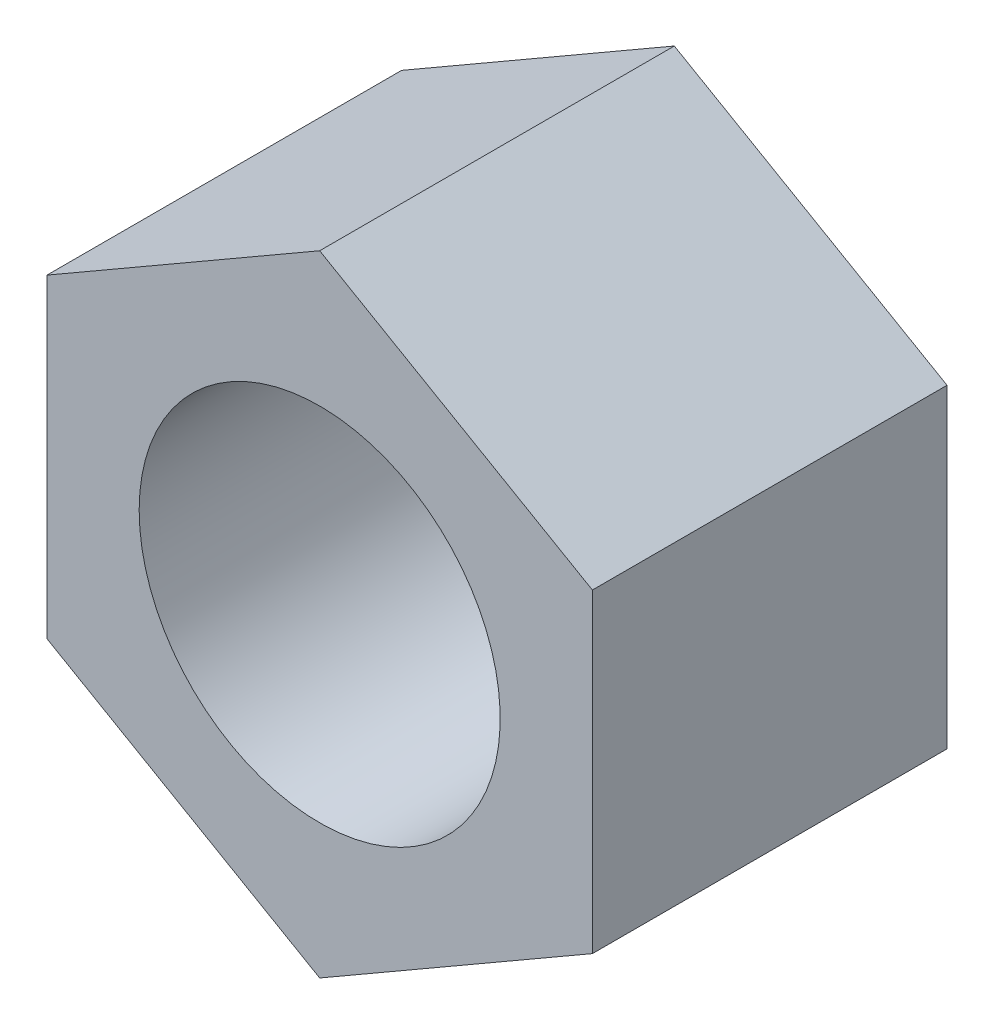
from build123d import *

# Parameters (mm, degrees)
SKETCH1_R      = 44.45
NUT_BODY_DEPTH = 87.3252


with BuildPart() as part:
    # Sketch1 → Nut body (new body)
    with BuildSketch(Plane(origin=(0, 0, 0), x_dir=(0, 1, 0), z_dir=(0, 0, 1))):
        Polygon((38.769792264, -67.15125), (77.539584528, 0), (38.769792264, 67.15125), (-38.769792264, 67.15125), (-77.539584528, 0), (-38.769792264, -67.15125), align=None)
        with Locations(Location((0, 0, 0), (0, 0, 90))):
            Circle(SKETCH1_R, mode=Mode.SUBTRACT)
    extrude(amount=NUT_BODY_DEPTH)


solid = part.part
